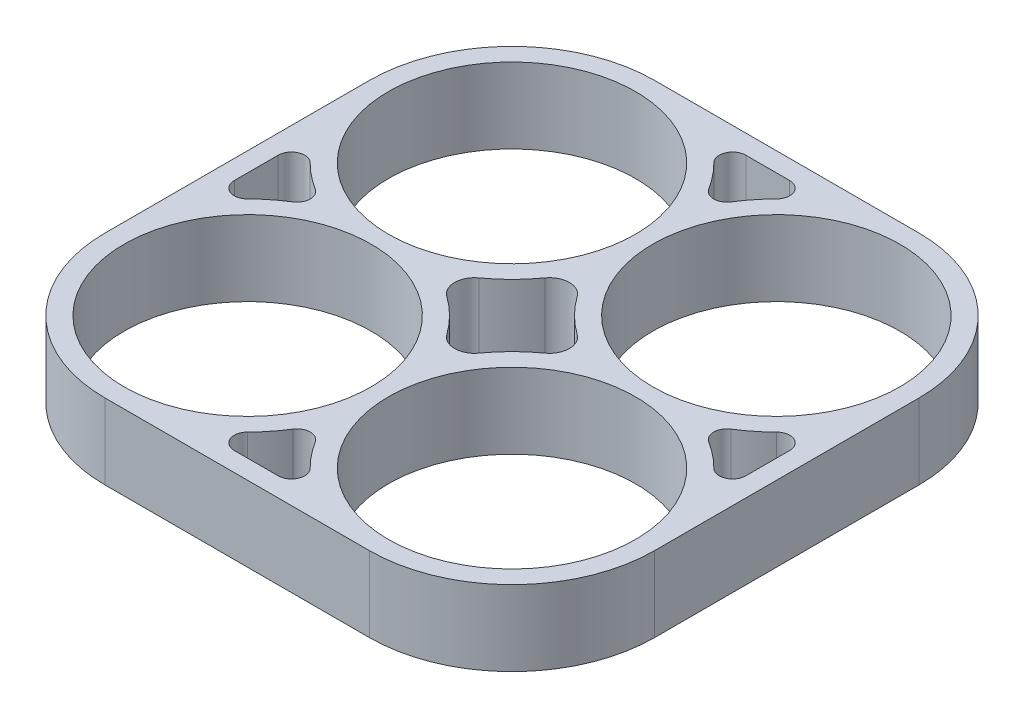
from build123d import *

# Parameters (mm, degrees)
SKIZZE1_R                       = 9.35
AUFSATZ_LINEAR_AUSTRAGEN1_DEPTH = 5.7


with BuildPart() as part:
    # Skizze1 → Aufsatz-Linear austragen1 (new body)
    with BuildSketch(Plane(origin=(0, 0, 0), x_dir=(1, 0, 0), z_dir=(0, 1, 0))):
        with BuildLine():
            Line((-10, 20.8), (10, 20.8))
            ThreePointArc((10, 20.8), (17.636753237, 17.636753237), (20.8, 10))
            Line((20.8, 10), (20.8, -10))
            ThreePointArc((20.8, -10), (17.636753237, -17.636753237), (10, -20.8))
            Line((10, -20.8), (-10, -20.8))
            ThreePointArc((-10, -20.8), (-17.636753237, -17.636753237), (-20.8, -10))
            Line((-20.8, -10), (-20.8, 10))
            ThreePointArc((-20.8, 10), (-17.636753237, 17.636753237), (-10, 20.8))
        make_face()
        with Locations(Location((-10, 10, 0), (0, 0, 270))):
            Circle(SKIZZE1_R, mode=Mode.SUBTRACT)
        with Locations(Location((10, 10, 0), (0, 0, 270))):
            Circle(SKIZZE1_R, mode=Mode.SUBTRACT)
        with Locations(Location((-10, -10, 0), (0, 0, 270))):
            Circle(SKIZZE1_R, mode=Mode.SUBTRACT)
        with Locations(Location((10, -10, 0), (0, 0, 270))):
            Circle(SKIZZE1_R, mode=Mode.SUBTRACT)
        with BuildLine():
            Line((-19.35, 1.662284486), (-19.35, -1.662284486))
            ThreePointArc((-19.35, -1.662284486), (-18.732343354, -2.58630481), (-17.642372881, -2.368870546))
            ThreePointArc((-17.642372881, -2.368870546), (-16.730970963, -1.554052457), (-15.733320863, -0.847457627))
            ThreePointArc((-15.733320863, -0.847457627), (-15.264183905, 0), (-15.733320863, 0.847457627))
            ThreePointArc((-15.733320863, 0.847457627), (-16.730970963, 1.554052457), (-17.642372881, 2.368870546))
            ThreePointArc((-17.642372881, 2.368870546), (-18.732343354, 2.58630481), (-19.35, 1.662284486))
        make_face(mode=Mode.SUBTRACT)
        with BuildLine():
            Line((-1.662284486, -19.35), (1.662284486, -19.35))
            ThreePointArc((1.662284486, -19.35), (2.58630481, -18.732343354), (2.368870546, -17.642372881))
            ThreePointArc((2.368870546, -17.642372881), (1.554052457, -16.730970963), (0.847457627, -15.733320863))
            ThreePointArc((0.847457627, -15.733320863), (0, -15.264183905), (-0.847457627, -15.733320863))
            ThreePointArc((-0.847457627, -15.733320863), (-1.554052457, -16.730970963), (-2.368870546, -17.642372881))
            ThreePointArc((-2.368870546, -17.642372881), (-2.58630481, -18.732343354), (-1.662284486, -19.35))
        make_face(mode=Mode.SUBTRACT)
        with BuildLine():
            Line((-1.662284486, 19.35), (1.662284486, 19.35))
            ThreePointArc((1.662284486, 19.35), (2.58630481, 18.732343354), (2.368870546, 17.642372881))
            ThreePointArc((2.368870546, 17.642372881), (1.554052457, 16.730970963), (0.847457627, 15.733320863))
            ThreePointArc((0.847457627, 15.733320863), (0, 15.264183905), (-0.847457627, 15.733320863))
            ThreePointArc((-0.847457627, 15.733320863), (-1.554052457, 16.730970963), (-2.368870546, 17.642372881))
            ThreePointArc((-2.368870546, 17.642372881), (-2.58630481, 18.732343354), (-1.662284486, 19.35))
        make_face(mode=Mode.SUBTRACT)
        with BuildLine():
            Line((19.35, 1.662284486), (19.35, -1.662284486))
            ThreePointArc((19.35, -1.662284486), (18.732343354, -2.58630481), (17.642372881, -2.368870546))
            ThreePointArc((17.642372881, -2.368870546), (16.730970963, -1.554052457), (15.733320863, -0.847457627))
            ThreePointArc((15.733320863, -0.847457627), (15.264183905, 0), (15.733320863, 0.847457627))
            ThreePointArc((15.733320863, 0.847457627), (16.730970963, 1.554052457), (17.642372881, 2.368870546))
            ThreePointArc((17.642372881, 2.368870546), (18.732343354, 2.58630481), (19.35, 1.662284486))
        make_face(mode=Mode.SUBTRACT)
        with BuildLine():
            ThreePointArc((1.219512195, 3.711674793), (2.363246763, 2.363246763), (3.711674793, 1.219512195))
            ThreePointArc((3.711674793, 1.219512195), (4.338296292, 0), (3.711674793, -1.219512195))
            ThreePointArc((3.711674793, -1.219512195), (2.363246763, -2.363246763), (1.219512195, -3.711674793))
            ThreePointArc((1.219512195, -3.711674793), (0, -4.338296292), (-1.219512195, -3.711674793))
            ThreePointArc((-1.219512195, -3.711674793), (-2.363246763, -2.363246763), (-3.711674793, -1.219512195))
            ThreePointArc((-3.711674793, -1.219512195), (-4.338296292, 0), (-3.711674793, 1.219512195))
            ThreePointArc((-3.711674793, 1.219512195), (-2.363246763, 2.363246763), (-1.219512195, 3.711674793))
            ThreePointArc((-1.219512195, 3.711674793), (0, 4.338296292), (1.219512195, 3.711674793))
        make_face(mode=Mode.SUBTRACT)
    extrude(amount=AUFSATZ_LINEAR_AUSTRAGEN1_DEPTH)


solid = part.part
